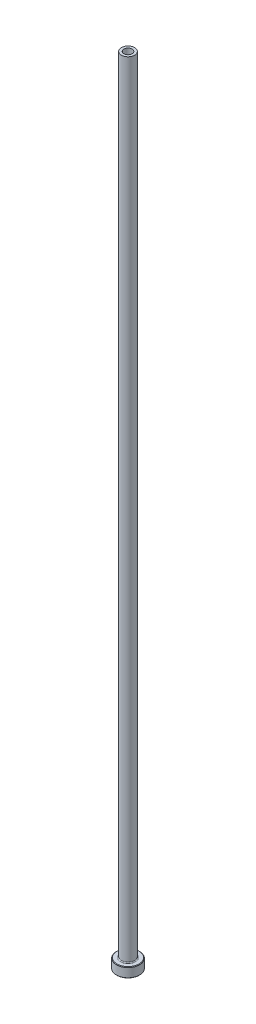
from build123d import *

# Parameters (mm, degrees)
CHAMFER1_SIZE = 0.254


with BuildPart() as part:
    # Sketch1 → Revolve1 (revolve)
    with BuildSketch(Plane.XY, mode=Mode.PRIVATE) as revolve1_sk:
        with BuildLine():
            Line((0, 0), (5.5499, 0))
            Line((5.5499, 0), (5.5499, 4.7498))
            Line((5.5499, 4.7498), (3.565525, 4.7498))
            ThreePointArc((3.565525, 4.7498), (3.284891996, 4.866041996), (3.16865, 5.146675))
            Line((3.16865, 5.146675), (3.16865, 381))
            Line((3.16865, 381), (0, 381))
            Line((0, 381), (0, 0))
        make_face()
    revolve(revolve1_sk.sketch.rotate(Axis((0, 0, 0), (0, 1, 0)), 90), axis=Axis((0, 0, 0), (0, 1, 0)))

    # Sketch2 → Cut-Revolve1 (revolve, cut)
    with BuildSketch(Plane.XY, mode=Mode.PRIVATE) as cut_revolve1_sk:
        Polygon((2.571115, 0), (2.17424, 0.396875), (2.17424, 306.5145), (1.98374, 320.802), (1.98374, 381), (0, 381), (0, 0), align=None)
    revolve(cut_revolve1_sk.sketch.rotate(Axis((0, 0, 0), (0, 1, 0)), 90), axis=Axis((0, 0, 0), (0, 1, 0)), mode=Mode.SUBTRACT)

    # Chamfer1
    chamfer1_edges = [part.edges().sort_by_distance(p)[0] for p in [
        (0, 4.7498, 5.5499),
        (0, 0, 5.5499),
    ]]
    chamfer(chamfer1_edges, length=CHAMFER1_SIZE)


solid = part.part
